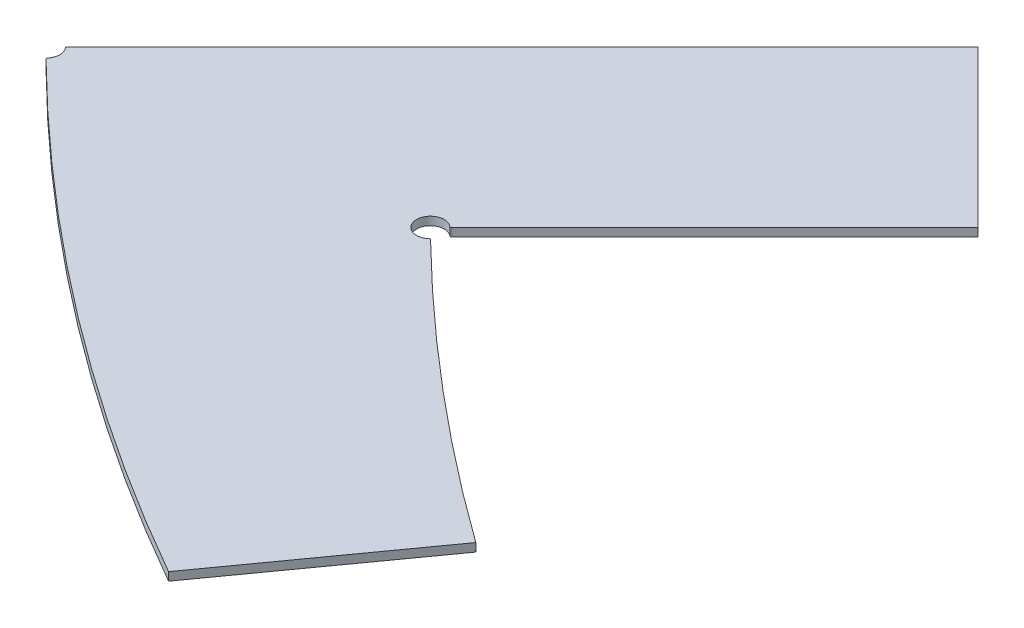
ISO-10303-21;
HEADER;
FILE_DESCRIPTION(('STEP AP214'),'2;1');
FILE_NAME('part.step','',(''),(''),'','','');
FILE_SCHEMA(('AUTOMOTIVE_DESIGN { 1 0 10303 214 1 1 1 1 }'));
ENDSEC;
DATA;
#1=APPLICATION_CONTEXT('core data for automotive mechanical design processes');
#2=APPLICATION_PROTOCOL_DEFINITION('international standard','automotive_design',2000,#1);
#3=PRODUCT_CONTEXT('',#1,'mechanical');
#4=PRODUCT('Part','Part','',(#3));
#5=PRODUCT_RELATED_PRODUCT_CATEGORY('part','',(#4));
#6=PRODUCT_DEFINITION_FORMATION('','',#4);
#7=PRODUCT_DEFINITION_CONTEXT('part definition',#1,'design');
#8=PRODUCT_DEFINITION('design','',#6,#7);
#9=PRODUCT_DEFINITION_SHAPE('','',#8);
#10=(LENGTH_UNIT() NAMED_UNIT(*) SI_UNIT(.MILLI.,.METRE.));
#11=(NAMED_UNIT(*) PLANE_ANGLE_UNIT() SI_UNIT($,.RADIAN.));
#12=(NAMED_UNIT(*) SI_UNIT($,.STERADIAN.) SOLID_ANGLE_UNIT());
#13=UNCERTAINTY_MEASURE_WITH_UNIT(LENGTH_MEASURE(1.E-05),#10,'distance_accuracy_value','');
#14=(GEOMETRIC_REPRESENTATION_CONTEXT(3) GLOBAL_UNCERTAINTY_ASSIGNED_CONTEXT((#13)) GLOBAL_UNIT_ASSIGNED_CONTEXT((#10,
#11,#12)) REPRESENTATION_CONTEXT('',''));
#15=CARTESIAN_POINT('',(0.,0.,0.));
#16=DIRECTION('',(0.,0.,1.));
#17=DIRECTION('',(1.,0.,0.));
#18=AXIS2_PLACEMENT_3D('',#15,#16,#17);
#19=CARTESIAN_POINT('',(-423.773946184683,0.952499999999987,398.811081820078));
#20=DIRECTION('',(0.,-1.,0.));
#21=DIRECTION('',(0.,0.,-1.));
#22=AXIS2_PLACEMENT_3D('',#19,#20,#21);
#23=CYLINDRICAL_SURFACE('',#22,0.253999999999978);
#24=CARTESIAN_POINT('',(-423.773946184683,-0.952500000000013,398.811081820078));
#25=DIRECTION('',(0.,1.,0.));
#26=DIRECTION('',(0.,0.,-1.));
#27=AXIS2_PLACEMENT_3D('',#24,#25,#26);
#28=CIRCLE('',#27,0.253999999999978);
#29=CARTESIAN_POINT('',(-423.953551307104,-0.952500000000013,398.631476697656));
#30=VERTEX_POINT('',#29);
#31=CARTESIAN_POINT('',(-423.966361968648,-0.952500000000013,398.976889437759));
#32=VERTEX_POINT('',#31);
#33=EDGE_CURVE('E161',#30,#32,#28,.T.);
#34=ORIENTED_EDGE('',*,*,#33,.T.);
#35=DIRECTION('',(0.,-1.,0.));
#36=VECTOR('',#35,1.);
#37=CARTESIAN_POINT('',(-423.966361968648,0.952499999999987,398.976889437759));
#38=LINE('',#37,#36);
#39=CARTESIAN_POINT('',(-423.966361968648,0.952499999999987,398.976889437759));
#40=VERTEX_POINT('',#39);
#41=EDGE_CURVE('E11',#40,#32,#38,.T.);
#42=ORIENTED_EDGE('',*,*,#41,.F.);
#43=CARTESIAN_POINT('',(-423.773946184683,0.952499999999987,398.811081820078));
#44=DIRECTION('',(0.,1.,0.));
#45=DIRECTION('',(0.,0.,-1.));
#46=AXIS2_PLACEMENT_3D('',#43,#44,#45);
#47=CIRCLE('',#46,0.253999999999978);
#48=CARTESIAN_POINT('',(-423.953551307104,0.952499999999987,398.631476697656));
#49=VERTEX_POINT('',#48);
#50=EDGE_CURVE('E183',#49,#40,#47,.T.);
#51=ORIENTED_EDGE('',*,*,#50,.F.);
#52=DIRECTION('',(0.,-1.,0.));
#53=VECTOR('',#52,1.);
#54=CARTESIAN_POINT('',(-423.953551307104,0.952499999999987,398.631476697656));
#55=LINE('',#54,#53);
#56=EDGE_CURVE('E157',#49,#30,#55,.T.);
#57=ORIENTED_EDGE('',*,*,#56,.T.);
#58=EDGE_LOOP('',(#34,#42,#51,#57));
#59=FACE_BOUND('',#58,.T.);
#60=ADVANCED_FACE('F41',(#59),#23,.T.);
#61=CARTESIAN_POINT('',(-426.371559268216,0.952499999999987,401.049484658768));
#62=DIRECTION('',(0.,-1.,0.));
#63=DIRECTION('',(0.,0.,-1.));
#64=AXIS2_PLACEMENT_3D('',#61,#62,#63);
#65=CYLINDRICAL_SURFACE('',#64,3.17499999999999);
#66=CARTESIAN_POINT('',(-426.371559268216,-0.952500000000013,401.049484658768));
#67=DIRECTION('',(0.,-1.,0.));
#68=DIRECTION('',(0.,0.,1.));
#69=AXIS2_PLACEMENT_3D('',#66,#67,#68);
#70=CIRCLE('',#69,3.17499999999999);
#71=CARTESIAN_POINT('',(-423.960009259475,-0.952500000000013,403.114684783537));
#72=VERTEX_POINT('',#71);
#73=EDGE_CURVE('E164',#32,#72,#70,.T.);
#74=ORIENTED_EDGE('',*,*,#73,.T.);
#75=DIRECTION('',(0.,-1.,0.));
#76=VECTOR('',#75,1.);
#77=CARTESIAN_POINT('',(-423.960009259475,0.952499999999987,403.114684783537));
#78=LINE('',#77,#76);
#79=CARTESIAN_POINT('',(-423.960009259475,0.952499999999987,403.114684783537));
#80=VERTEX_POINT('',#79);
#81=EDGE_CURVE('E49',#80,#72,#78,.T.);
#82=ORIENTED_EDGE('',*,*,#81,.F.);
#83=CARTESIAN_POINT('',(-426.371559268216,0.952499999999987,401.049484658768));
#84=DIRECTION('',(0.,-1.,0.));
#85=DIRECTION('',(0.,0.,1.));
#86=AXIS2_PLACEMENT_3D('',#83,#84,#85);
#87=CIRCLE('',#86,3.17499999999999);
#88=EDGE_CURVE('E112',#40,#80,#87,.T.);
#89=ORIENTED_EDGE('',*,*,#88,.F.);
#90=ORIENTED_EDGE('',*,*,#41,.T.);
#91=EDGE_LOOP('',(#74,#82,#89,#90));
#92=FACE_BOUND('',#91,.T.);
#93=ADVANCED_FACE('F261',(#92),#65,.F.);
#94=CARTESIAN_POINT('',(-423.767085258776,0.952499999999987,403.279900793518));
#95=DIRECTION('',(0.,-1.,0.));
#96=DIRECTION('',(0.,0.,-1.));
#97=AXIS2_PLACEMENT_3D('',#94,#95,#96);
#98=CYLINDRICAL_SURFACE('',#97,0.254000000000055);
#99=CARTESIAN_POINT('',(-423.767085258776,-0.952500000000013,403.279900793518));
#100=DIRECTION('',(0.,1.,0.));
#101=DIRECTION('',(0.,0.,-1.));
#102=AXIS2_PLACEMENT_3D('',#99,#100,#101);
#103=CIRCLE('',#102,0.254000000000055);
#104=CARTESIAN_POINT('',(-423.945583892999,-0.952500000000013,403.460605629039));
#105=VERTEX_POINT('',#104);
#106=EDGE_CURVE('E166',#72,#105,#103,.T.);
#107=ORIENTED_EDGE('',*,*,#106,.T.);
#108=DIRECTION('',(0.,-1.,0.));
#109=VECTOR('',#108,1.);
#110=CARTESIAN_POINT('',(-423.945583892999,0.952499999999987,403.460605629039));
#111=LINE('',#110,#109);
#112=CARTESIAN_POINT('',(-423.945583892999,0.952499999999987,403.460605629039));
#113=VERTEX_POINT('',#112);
#114=EDGE_CURVE('E202',#113,#105,#111,.T.);
#115=ORIENTED_EDGE('',*,*,#114,.F.);
#116=CARTESIAN_POINT('',(-423.767085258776,0.952499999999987,403.279900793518));
#117=DIRECTION('',(0.,1.,0.));
#118=DIRECTION('',(0.,0.,-1.));
#119=AXIS2_PLACEMENT_3D('',#116,#117,#118);
#120=CIRCLE('',#119,0.254000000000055);
#121=EDGE_CURVE('E210',#80,#113,#120,.T.);
#122=ORIENTED_EDGE('',*,*,#121,.F.);
#123=ORIENTED_EDGE('',*,*,#81,.T.);
#124=EDGE_LOOP('',(#107,#115,#122,#123));
#125=FACE_BOUND('',#124,.T.);
#126=ADVANCED_FACE('F208',(#125),#98,.T.);
#127=CARTESIAN_POINT('',(-32.5873283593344,0.952499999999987,7.26525374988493));
#128=DIRECTION('',(0.,-1.,0.));
#129=DIRECTION('',(0.,0.,-1.));
#130=AXIS2_PLACEMENT_3D('',#127,#128,#129);
#131=CYLINDRICAL_SURFACE('',#130,556.895);
#132=CARTESIAN_POINT('',(-32.5873283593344,-0.952500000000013,7.26525374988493));
#133=DIRECTION('',(0.,1.,0.));
#134=DIRECTION('',(0.,0.,1.));
#135=AXIS2_PLACEMENT_3D('',#132,#133,#134);
#136=CIRCLE('',#135,556.895);
#137=CARTESIAN_POINT('',(-307.938058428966,-0.952500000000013,491.325184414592));
#138=VERTEX_POINT('',#137);
#139=EDGE_CURVE('E168',#105,#138,#136,.T.);
#140=ORIENTED_EDGE('',*,*,#139,.T.);
#141=DIRECTION('',(0.,-1.,0.));
#142=VECTOR('',#141,1.);
#143=CARTESIAN_POINT('',(-307.938058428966,0.952499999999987,491.325184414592));
#144=LINE('',#143,#142);
#145=CARTESIAN_POINT('',(-307.938058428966,0.952499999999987,491.325184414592));
#146=VERTEX_POINT('',#145);
#147=EDGE_CURVE('E199',#146,#138,#144,.T.);
#148=ORIENTED_EDGE('',*,*,#147,.F.);
#149=CARTESIAN_POINT('',(-32.5873283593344,0.952499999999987,7.26525374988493));
#150=DIRECTION('',(0.,1.,0.));
#151=DIRECTION('',(0.,0.,1.));
#152=AXIS2_PLACEMENT_3D('',#149,#150,#151);
#153=CIRCLE('',#152,556.895);
#154=EDGE_CURVE('E228',#113,#146,#153,.T.);
#155=ORIENTED_EDGE('',*,*,#154,.F.);
#156=ORIENTED_EDGE('',*,*,#114,.T.);
#157=EDGE_LOOP('',(#140,#148,#155,#156));
#158=FACE_BOUND('',#157,.T.);
#159=ADVANCED_FACE('F219',(#158),#131,.T.);
#160=CARTESIAN_POINT('',(-278.456861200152,0.952499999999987,450.267211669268));
#161=DIRECTION('',(-0.812289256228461,0.,-0.583254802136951));
#162=DIRECTION('',(-0.583254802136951,0.,0.812289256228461));
#163=AXIS2_PLACEMENT_3D('',#160,#161,#162);
#164=PLANE('',#163);
#165=DIRECTION('',(0.583254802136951,0.,-0.812289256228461));
#166=VECTOR('',#165,1.);
#167=CARTESIAN_POINT('',(-278.456861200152,-0.952500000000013,450.267211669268));
#168=LINE('',#167,#166);
#169=CARTESIAN_POINT('',(-278.456861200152,-0.952500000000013,450.267211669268));
#170=VERTEX_POINT('',#169);
#171=EDGE_CURVE('E170',#138,#170,#168,.T.);
#172=ORIENTED_EDGE('',*,*,#171,.T.);
#173=DIRECTION('',(0.,-1.,0.));
#174=VECTOR('',#173,1.);
#175=CARTESIAN_POINT('',(-278.456861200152,0.952499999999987,450.267211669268));
#176=LINE('',#175,#174);
#177=CARTESIAN_POINT('',(-278.456861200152,0.952499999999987,450.267211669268));
#178=VERTEX_POINT('',#177);
#179=EDGE_CURVE('E196',#178,#170,#176,.T.);
#180=ORIENTED_EDGE('',*,*,#179,.F.);
#181=DIRECTION('',(0.583254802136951,0.,-0.812289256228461));
#182=VECTOR('',#181,1.);
#183=CARTESIAN_POINT('',(-278.456861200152,0.952499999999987,450.267211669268));
#184=LINE('',#183,#182);
#185=EDGE_CURVE('E225',#146,#178,#184,.T.);
#186=ORIENTED_EDGE('',*,*,#185,.F.);
#187=ORIENTED_EDGE('',*,*,#147,.T.);
#188=EDGE_LOOP('',(#172,#180,#186,#187));
#189=FACE_BOUND('',#188,.T.);
#190=ADVANCED_FACE('F223',(#189),#164,.F.);
#191=CARTESIAN_POINT('',(47.4659222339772,0.952499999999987,-3.64002471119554));
#192=DIRECTION('',(0.,-1.,0.));
#193=DIRECTION('',(0.,0.,-1.));
#194=AXIS2_PLACEMENT_3D('',#191,#192,#193);
#195=CYLINDRICAL_SURFACE('',#194,558.8);
#196=CARTESIAN_POINT('',(47.4659222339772,-0.952500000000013,-3.64002471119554));
#197=DIRECTION('',(0.,-1.,0.));
#198=DIRECTION('',(0.,0.,1.));
#199=AXIS2_PLACEMENT_3D('',#196,#197,#198);
#200=CIRCLE('',#199,558.8);
#201=CARTESIAN_POINT('',(-343.882968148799,-0.952500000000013,395.237758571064));
#202=VERTEX_POINT('',#201);
#203=EDGE_CURVE('E172',#170,#202,#200,.T.);
#204=ORIENTED_EDGE('',*,*,#203,.T.);
#205=DIRECTION('',(0.,-1.,0.));
#206=VECTOR('',#205,1.);
#207=CARTESIAN_POINT('',(-343.882968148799,0.952499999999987,395.237758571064));
#208=LINE('',#207,#206);
#209=CARTESIAN_POINT('',(-343.882968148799,0.952499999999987,395.237758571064));
#210=VERTEX_POINT('',#209);
#211=EDGE_CURVE('E193',#210,#202,#208,.T.);
#212=ORIENTED_EDGE('',*,*,#211,.F.);
#213=CARTESIAN_POINT('',(47.4659222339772,0.952499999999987,-3.64002471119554));
#214=DIRECTION('',(0.,-1.,0.));
#215=DIRECTION('',(0.,0.,1.));
#216=AXIS2_PLACEMENT_3D('',#213,#214,#215);
#217=CIRCLE('',#216,558.8);
#218=EDGE_CURVE('E227',#178,#210,#217,.T.);
#219=ORIENTED_EDGE('',*,*,#218,.F.);
#220=ORIENTED_EDGE('',*,*,#179,.T.);
#221=EDGE_LOOP('',(#204,#212,#219,#220));
#222=FACE_BOUND('',#221,.T.);
#223=ADVANCED_FACE('F274',(#222),#195,.F.);
#224=CARTESIAN_POINT('',(-344.060854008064,0.952499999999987,395.419066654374));
#225=DIRECTION('',(0.,-1.,0.));
#226=DIRECTION('',(0.,0.,-1.));
#227=AXIS2_PLACEMENT_3D('',#224,#225,#226);
#228=CYLINDRICAL_SURFACE('',#227,0.254000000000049);
#229=CARTESIAN_POINT('',(-344.060854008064,-0.952500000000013,395.419066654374));
#230=DIRECTION('',(0.,1.,0.));
#231=DIRECTION('',(0.,0.,-1.));
#232=AXIS2_PLACEMENT_3D('',#229,#230,#231);
#233=CIRCLE('',#232,0.254000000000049);
#234=CARTESIAN_POINT('',(-344.227902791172,-0.952500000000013,395.227727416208));
#235=VERTEX_POINT('',#234);
#236=EDGE_CURVE('E174',#202,#235,#233,.T.);
#237=ORIENTED_EDGE('',*,*,#236,.T.);
#238=DIRECTION('',(0.,-1.,0.));
#239=VECTOR('',#238,1.);
#240=CARTESIAN_POINT('',(-344.227902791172,0.952499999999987,395.227727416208));
#241=LINE('',#240,#239);
#242=CARTESIAN_POINT('',(-344.227902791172,0.952499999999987,395.227727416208));
#243=VERTEX_POINT('',#242);
#244=EDGE_CURVE('E190',#243,#235,#241,.T.);
#245=ORIENTED_EDGE('',*,*,#244,.F.);
#246=CARTESIAN_POINT('',(-344.060854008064,0.952499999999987,395.419066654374));
#247=DIRECTION('',(0.,1.,0.));
#248=DIRECTION('',(0.,0.,-1.));
#249=AXIS2_PLACEMENT_3D('',#246,#247,#248);
#250=CIRCLE('',#249,0.254000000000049);
#251=EDGE_CURVE('E230',#210,#243,#250,.T.);
#252=ORIENTED_EDGE('',*,*,#251,.F.);
#253=ORIENTED_EDGE('',*,*,#211,.T.);
#254=EDGE_LOOP('',(#237,#245,#252,#253));
#255=FACE_BOUND('',#254,.T.);
#256=ADVANCED_FACE('F277',(#255),#228,.T.);
#257=CARTESIAN_POINT('',(-346.31601258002,0.952499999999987,392.835986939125));
#258=DIRECTION('',(0.,-1.,0.));
#259=DIRECTION('',(0.,0.,-1.));
#260=AXIS2_PLACEMENT_3D('',#257,#258,#259);
#261=CYLINDRICAL_SURFACE('',#260,3.17500000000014);
#262=CARTESIAN_POINT('',(-346.31601258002,-0.952500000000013,392.835986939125));
#263=DIRECTION('',(0.,-1.,0.));
#264=DIRECTION('',(0.,0.,1.));
#265=AXIS2_PLACEMENT_3D('',#262,#263,#264);
#266=CIRCLE('',#265,3.17500000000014);
#267=CARTESIAN_POINT('',(-344.24341735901,-0.952500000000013,390.430789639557));
#268=VERTEX_POINT('',#267);
#269=EDGE_CURVE('E176',#235,#268,#266,.T.);
#270=ORIENTED_EDGE('',*,*,#269,.T.);
#271=DIRECTION('',(0.,-1.,0.));
#272=VECTOR('',#271,1.);
#273=CARTESIAN_POINT('',(-344.24341735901,0.952499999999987,390.430789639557));
#274=LINE('',#273,#272);
#275=CARTESIAN_POINT('',(-344.24341735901,0.952499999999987,390.430789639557));
#276=VERTEX_POINT('',#275);
#277=EDGE_CURVE('E187',#276,#268,#274,.T.);
#278=ORIENTED_EDGE('',*,*,#277,.F.);
#279=CARTESIAN_POINT('',(-346.31601258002,0.952499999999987,392.835986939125));
#280=DIRECTION('',(0.,-1.,0.));
#281=DIRECTION('',(0.,0.,1.));
#282=AXIS2_PLACEMENT_3D('',#279,#280,#281);
#283=CIRCLE('',#282,3.17500000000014);
#284=EDGE_CURVE('E236',#243,#276,#283,.T.);
#285=ORIENTED_EDGE('',*,*,#284,.F.);
#286=ORIENTED_EDGE('',*,*,#244,.T.);
#287=EDGE_LOOP('',(#270,#278,#285,#286));
#288=FACE_BOUND('',#287,.T.);
#289=ADVANCED_FACE('F242',(#288),#261,.F.);
#290=CARTESIAN_POINT('',(-344.077609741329,0.952499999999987,390.238373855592));
#291=DIRECTION('',(0.,-1.,0.));
#292=DIRECTION('',(0.,0.,-1.));
#293=AXIS2_PLACEMENT_3D('',#290,#291,#292);
#294=CYLINDRICAL_SURFACE('',#293,0.253999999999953);
#295=CARTESIAN_POINT('',(-344.077609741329,-0.952500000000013,390.238373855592));
#296=DIRECTION('',(0.,1.,0.));
#297=DIRECTION('',(0.,0.,1.));
#298=AXIS2_PLACEMENT_3D('',#295,#296,#297);
#299=CIRCLE('',#298,0.253999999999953);
#300=CARTESIAN_POINT('',(-343.898004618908,-0.952500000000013,390.417978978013));
#301=VERTEX_POINT('',#300);
#302=EDGE_CURVE('E178',#268,#301,#299,.T.);
#303=ORIENTED_EDGE('',*,*,#302,.T.);
#304=DIRECTION('',(0.,-1.,0.));
#305=VECTOR('',#304,1.);
#306=CARTESIAN_POINT('',(-343.898004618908,0.952499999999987,390.417978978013));
#307=LINE('',#306,#305);
#308=CARTESIAN_POINT('',(-343.898004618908,0.952499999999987,390.417978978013));
#309=VERTEX_POINT('',#308);
#310=EDGE_CURVE('E152',#309,#301,#307,.T.);
#311=ORIENTED_EDGE('',*,*,#310,.F.);
#312=CARTESIAN_POINT('',(-344.077609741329,0.952499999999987,390.238373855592));
#313=DIRECTION('',(0.,1.,0.));
#314=DIRECTION('',(0.,0.,1.));
#315=AXIS2_PLACEMENT_3D('',#312,#313,#314);
#316=CIRCLE('',#315,0.253999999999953);
#317=EDGE_CURVE('E143',#276,#309,#316,.T.);
#318=ORIENTED_EDGE('',*,*,#317,.F.);
#319=ORIENTED_EDGE('',*,*,#277,.T.);
#320=EDGE_LOOP('',(#303,#311,#318,#319));
#321=FACE_BOUND('',#320,.T.);
#322=ADVANCED_FACE('F246',(#321),#294,.T.);
#323=CARTESIAN_POINT('',(-283.454219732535,0.952499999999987,329.974194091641));
#324=DIRECTION('',(-0.707106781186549,0.,-0.707106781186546));
#325=DIRECTION('',(-0.707106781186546,0.,0.707106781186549));
#326=AXIS2_PLACEMENT_3D('',#323,#324,#325);
#327=PLANE('',#326);
#328=DIRECTION('',(0.707106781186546,0.,-0.707106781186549));
#329=VECTOR('',#328,1.);
#330=CARTESIAN_POINT('',(-283.454219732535,-0.952500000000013,329.974194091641));
#331=LINE('',#330,#329);
#332=CARTESIAN_POINT('',(-283.454219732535,-0.952500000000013,329.974194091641));
#333=VERTEX_POINT('',#332);
#334=EDGE_CURVE('E151',#301,#333,#331,.T.);
#335=ORIENTED_EDGE('',*,*,#334,.T.);
#336=DIRECTION('',(0.,-1.,0.));
#337=VECTOR('',#336,1.);
#338=CARTESIAN_POINT('',(-283.454219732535,0.952499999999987,329.974194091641));
#339=LINE('',#338,#337);
#340=CARTESIAN_POINT('',(-283.454219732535,0.952499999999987,329.974194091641));
#341=VERTEX_POINT('',#340);
#342=EDGE_CURVE('E148',#341,#333,#339,.T.);
#343=ORIENTED_EDGE('',*,*,#342,.F.);
#344=DIRECTION('',(0.707106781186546,0.,-0.707106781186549));
#345=VECTOR('',#344,1.);
#346=CARTESIAN_POINT('',(-283.454219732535,0.952499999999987,329.974194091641));
#347=LINE('',#346,#345);
#348=EDGE_CURVE('E137',#309,#341,#347,.T.);
#349=ORIENTED_EDGE('',*,*,#348,.F.);
#350=ORIENTED_EDGE('',*,*,#310,.T.);
#351=EDGE_LOOP('',(#335,#343,#349,#350));
#352=FACE_BOUND('',#351,.T.);
#353=ADVANCED_FACE('F149',(#352),#327,.F.);
#354=CARTESIAN_POINT('',(-319.375244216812,0.952499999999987,294.053169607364));
#355=DIRECTION('',(-0.707106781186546,0.,0.707106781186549));
#356=DIRECTION('',(0.707106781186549,0.,0.707106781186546));
#357=AXIS2_PLACEMENT_3D('',#354,#355,#356);
#358=PLANE('',#357);
#359=DIRECTION('',(-0.707106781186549,0.,-0.707106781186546));
#360=VECTOR('',#359,1.);
#361=CARTESIAN_POINT('',(-319.375244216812,-0.952500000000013,294.053169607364));
#362=LINE('',#361,#360);
#363=CARTESIAN_POINT('',(-319.375244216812,-0.952500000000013,294.053169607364));
#364=VERTEX_POINT('',#363);
#365=EDGE_CURVE('E98',#333,#364,#362,.T.);
#366=ORIENTED_EDGE('',*,*,#365,.T.);
#367=DIRECTION('',(0.,-1.,0.));
#368=VECTOR('',#367,1.);
#369=CARTESIAN_POINT('',(-319.375244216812,0.952499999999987,294.053169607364));
#370=LINE('',#369,#368);
#371=CARTESIAN_POINT('',(-319.375244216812,0.952499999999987,294.053169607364));
#372=VERTEX_POINT('',#371);
#373=EDGE_CURVE('E153',#372,#364,#370,.T.);
#374=ORIENTED_EDGE('',*,*,#373,.F.);
#375=DIRECTION('',(-0.707106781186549,0.,-0.707106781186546));
#376=VECTOR('',#375,1.);
#377=CARTESIAN_POINT('',(-319.375244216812,0.952499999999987,294.053169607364));
#378=LINE('',#377,#376);
#379=EDGE_CURVE('E141',#341,#372,#378,.T.);
#380=ORIENTED_EDGE('',*,*,#379,.F.);
#381=ORIENTED_EDGE('',*,*,#342,.T.);
#382=EDGE_LOOP('',(#366,#374,#380,#381));
#383=FACE_BOUND('',#382,.T.);
#384=ADVANCED_FACE('F155',(#383),#358,.F.);
#385=CARTESIAN_POINT('',(-423.953551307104,0.952499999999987,398.631476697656));
#386=DIRECTION('',(0.707106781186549,0.,0.707106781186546));
#387=DIRECTION('',(0.707106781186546,0.,-0.707106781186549));
#388=AXIS2_PLACEMENT_3D('',#385,#386,#387);
#389=PLANE('',#388);
#390=DIRECTION('',(-0.707106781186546,0.,0.707106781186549));
#391=VECTOR('',#390,1.);
#392=CARTESIAN_POINT('',(-423.953551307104,-0.952500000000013,398.631476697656));
#393=LINE('',#392,#391);
#394=EDGE_CURVE('E104',#364,#30,#393,.T.);
#395=ORIENTED_EDGE('',*,*,#394,.T.);
#396=ORIENTED_EDGE('',*,*,#56,.F.);
#397=DIRECTION('',(-0.707106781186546,0.,0.707106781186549));
#398=VECTOR('',#397,1.);
#399=CARTESIAN_POINT('',(-423.953551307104,0.952499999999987,398.631476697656));
#400=LINE('',#399,#398);
#401=EDGE_CURVE('E57',#372,#49,#400,.T.);
#402=ORIENTED_EDGE('',*,*,#401,.F.);
#403=ORIENTED_EDGE('',*,*,#373,.T.);
#404=EDGE_LOOP('',(#395,#396,#402,#403));
#405=FACE_BOUND('',#404,.T.);
#406=ADVANCED_FACE('F250',(#405),#389,.F.);
#407=CARTESIAN_POINT('',(-423.773946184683,0.952499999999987,398.811081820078));
#408=DIRECTION('',(0.,-1.,0.));
#409=DIRECTION('',(0.,0.,-1.));
#410=AXIS2_PLACEMENT_3D('',#407,#408,#409);
#411=PLANE('',#410);
#412=ORIENTED_EDGE('',*,*,#50,.T.);
#413=ORIENTED_EDGE('',*,*,#88,.T.);
#414=ORIENTED_EDGE('',*,*,#121,.T.);
#415=ORIENTED_EDGE('',*,*,#154,.T.);
#416=ORIENTED_EDGE('',*,*,#185,.T.);
#417=ORIENTED_EDGE('',*,*,#218,.T.);
#418=ORIENTED_EDGE('',*,*,#251,.T.);
#419=ORIENTED_EDGE('',*,*,#284,.T.);
#420=ORIENTED_EDGE('',*,*,#317,.T.);
#421=ORIENTED_EDGE('',*,*,#348,.T.);
#422=ORIENTED_EDGE('',*,*,#379,.T.);
#423=ORIENTED_EDGE('',*,*,#401,.T.);
#424=EDGE_LOOP('',(#412,#413,#414,#415,#416,#417,#418,#419,#420,#421,#422,#423));
#425=FACE_BOUND('',#424,.T.);
#426=ADVANCED_FACE('F139',(#425),#411,.F.);
#427=CARTESIAN_POINT('',(-423.773946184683,-0.952500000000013,398.811081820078));
#428=DIRECTION('',(0.,-1.,0.));
#429=DIRECTION('',(0.,0.,-1.));
#430=AXIS2_PLACEMENT_3D('',#427,#428,#429);
#431=PLANE('',#430);
#432=ORIENTED_EDGE('',*,*,#33,.F.);
#433=ORIENTED_EDGE('',*,*,#394,.F.);
#434=ORIENTED_EDGE('',*,*,#365,.F.);
#435=ORIENTED_EDGE('',*,*,#334,.F.);
#436=ORIENTED_EDGE('',*,*,#302,.F.);
#437=ORIENTED_EDGE('',*,*,#269,.F.);
#438=ORIENTED_EDGE('',*,*,#236,.F.);
#439=ORIENTED_EDGE('',*,*,#203,.F.);
#440=ORIENTED_EDGE('',*,*,#171,.F.);
#441=ORIENTED_EDGE('',*,*,#139,.F.);
#442=ORIENTED_EDGE('',*,*,#106,.F.);
#443=ORIENTED_EDGE('',*,*,#73,.F.);
#444=EDGE_LOOP('',(#432,#433,#434,#435,#436,#437,#438,#439,#440,#441,#442,#443));
#445=FACE_BOUND('',#444,.T.);
#446=ADVANCED_FACE('F214',(#445),#431,.T.);
#447=CLOSED_SHELL('',(#60,#93,#126,#159,#190,#223,#256,#289,#322,#353,#384,#406,#426,#446));
#448=MANIFOLD_SOLID_BREP('B2',#447);
#449=ADVANCED_BREP_SHAPE_REPRESENTATION('',(#18,#448),#14);
#450=SHAPE_DEFINITION_REPRESENTATION(#9,#449);
ENDSEC;
END-ISO-10303-21;
